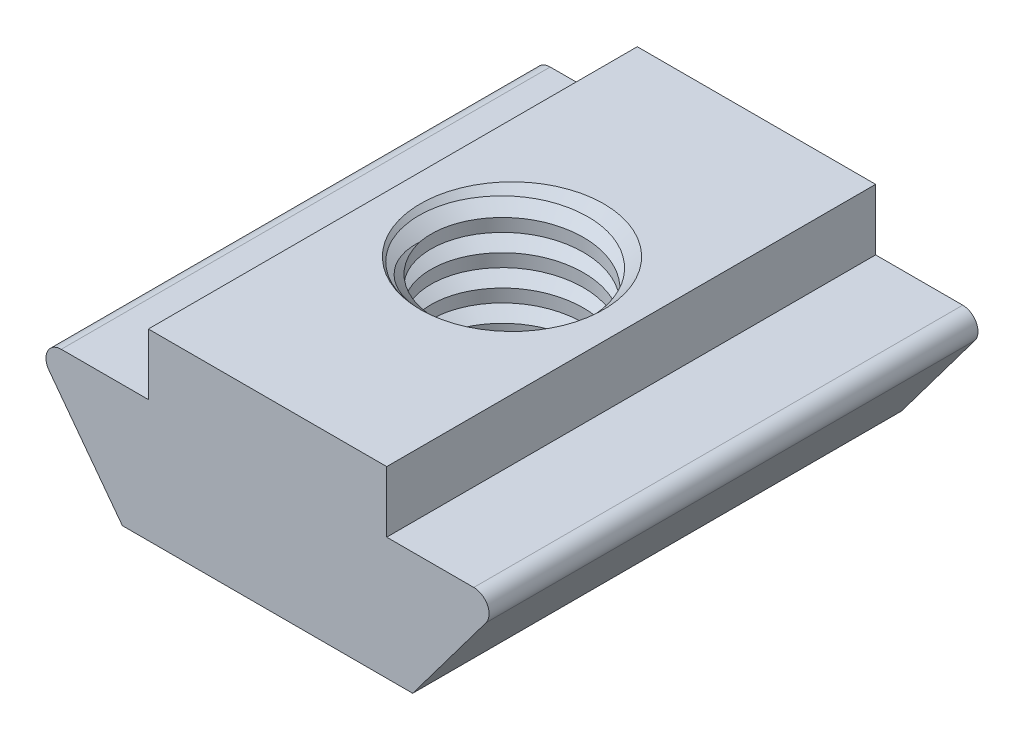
from build123d import *

# Parameters (mm, degrees)
EXTRUDE_1_DEPTH     = 8
SKETCH_7_R          = 2.5
CUT_EXTRUDE_2_DEPTH = 16
CHAMFER_2_SIZE      = 0.5
FILLET_2_R          = 0.5


with BuildPart() as part:
    # Sketch 1 → Extrude 1 (new, symmetric)
    with BuildSketch(Plane.XY):
        Polygon((-3.9, 4), (-3.9, 6), (3.9, 6), (3.9, 4), (7.75, 4), (4.75, 0), (-4.75, 0), (-7.75, 4), align=None)
    extrude(amount=EXTRUDE_1_DEPTH, both=True)

    # Sketch 7 → Cut-Extrude 2 (cut)
    with BuildSketch(Plane(origin=(0, 6, 0), x_dir=(1, 0, 0), z_dir=(0, 1, 0))):
        with Locations(Location((0, 0, 0), (0, 0, 180))):
            Circle(SKETCH_7_R)
    extrude(amount=-CUT_EXTRUDE_2_DEPTH, mode=Mode.SUBTRACT)

    # Chamfer 2
    chamfer_2_edges = [part.edges().sort_by_distance(p)[0] for p in [
        (2.5, 0, 0),
        (2.5, 6, 0),
    ]]
    chamfer(chamfer_2_edges, length=CHAMFER_2_SIZE)

    # Sweep 3: sweep along a curve in space
    with BuildLine() as sweep_3_path:
        add(Edge.make_bspline(
            [(-2.121320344, 6, -2.121320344), (-1.84541595, 5.979299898, -2.397224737), (-1.177131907, 5.937438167, -2.84460242), (-0.000216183, 5.875016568, -3.07788601), (1.177996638, 5.812495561, -2.843853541), (2.176531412, 5.75000119, -2.176531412), (2.843799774, 5.687499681, -1.177942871), (3.078101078, 5.625000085, 1.114e-06), (2.843795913, 5.562499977, 1.177938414), (2.176546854, 5.500000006, 2.176547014), (1.177938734, 5.437499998, 2.843795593), (-6e-09, 5.375, 3.078102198), (-1.177938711, 5.3125, 2.843795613), (-2.176546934, 5.25, 2.176546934), (-2.843795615, 5.1875, 1.177938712), (-3.078102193, 5.125, 0), (-2.843795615, 5.0625, -1.177938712), (-2.176546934, 5, -2.176546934), (-1.177938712, 4.9375, -2.843795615), (0, 4.875, -3.078102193), (1.177938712, 4.8125, -2.843795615), (2.176546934, 4.75, -2.176546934), (2.843795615, 4.6875, -1.177938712), (3.078102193, 4.625, 0), (2.843795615, 4.5625, 1.177938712), (2.176546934, 4.5, 2.176546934), (1.177938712, 4.4375, 2.843795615), (0, 4.375, 3.078102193), (-1.177938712, 4.3125, 2.843795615), (-2.176546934, 4.25, 2.176546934), (-2.843795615, 4.1875, 1.177938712), (-3.078102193, 4.125, 0), (-2.843795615, 4.0625, -1.177938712), (-2.176546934, 4, -2.176546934), (-1.177938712, 3.9375, -2.843795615), (0, 3.875, -3.078102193), (1.177938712, 3.8125, -2.843795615), (2.176546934, 3.75, -2.176546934), (2.843795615, 3.6875, -1.177938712), (3.078102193, 3.625, 0), (2.843795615, 3.5625, 1.177938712), (2.176546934, 3.5, 2.176546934), (1.177938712, 3.4375, 2.843795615), (0, 3.375, 3.078102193), (-1.177938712, 3.3125, 2.843795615), (-2.176546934, 3.25, 2.176546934), (-2.843795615, 3.1875, 1.177938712), (-3.078102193, 3.125, 0), (-2.843795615, 3.0625, -1.177938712), (-2.176546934, 3, -2.176546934), (-1.177938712, 2.9375, -2.843795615), (0, 2.875, -3.078102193), (1.177938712, 2.8125, -2.843795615), (2.176546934, 2.75, -2.176546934), (2.843795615, 2.6875, -1.177938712), (3.078102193, 2.625, 0), (2.843795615, 2.5625, 1.177938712), (2.176546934, 2.5, 2.176546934), (1.177938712, 2.4375, 2.843795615), (0, 2.375, 3.078102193), (-1.177938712, 2.3125, 2.843795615), (-2.176546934, 2.25, 2.176546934), (-2.843795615, 2.1875, 1.177938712), (-3.078102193, 2.125, 0), (-2.843795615, 2.0625, -1.177938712), (-2.176546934, 2, -2.176546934), (-1.177938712, 1.9375, -2.843795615), (0, 1.875, -3.078102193), (1.177938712, 1.8125, -2.843795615), (2.176546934, 1.75, -2.176546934), (2.843795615, 1.6875, -1.177938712), (3.078102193, 1.625, 0), (2.843795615, 1.5625, 1.177938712), (2.176546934, 1.5, 2.176546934), (1.177938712, 1.4375, 2.843795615), (0, 1.375, 3.078102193), (-1.177938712, 1.3125, 2.843795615), (-2.176546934, 1.25, 2.176546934), (-2.843795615, 1.1875, 1.177938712), (-3.078102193, 1.125, 0), (-2.843795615, 1.0625, -1.177938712), (-2.176546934, 1, -2.176546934), (-1.177938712, 0.9375, -2.843795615), (0, 0.875, -3.078102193), (1.177938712, 0.8125, -2.843795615), (2.176546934, 0.75, -2.176546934), (2.843795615, 0.6875, -1.177938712), (3.078102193, 0.625, 0), (2.843795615, 0.5625, 1.177938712), (2.176546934, 0.5, 2.176546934), (1.177938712, 0.4375, 2.843795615), (0, 0.375, 3.078102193), (-1.177938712, 0.3125, 2.843795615), (-2.176546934, 0.25, 2.176546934), (-2.843795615, 0.1875, 1.177938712), (-3.078102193, 0.125, 0), (-2.843795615, 0.0625, -1.177938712), (-2.176546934, 0, -2.176546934), (-1.177938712, -0.0625, -2.843795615), (0, -0.125, -3.078102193), (1.177938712, -0.1875, -2.843795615), (2.176546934, -0.25, -2.176546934), (2.843795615, -0.3125, -1.177938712), (3.078102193, -0.375, 0), (2.843795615, -0.4375, 1.177938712), (2.176546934, -0.5, 2.176546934), (1.177938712, -0.5625, 2.843795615), (0, -0.625, 3.078102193), (-1.177938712, -0.6875, 2.843795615), (-2.176546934, -0.75, 2.176546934), (-2.843795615, -0.8125, 1.177938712), (-3.078102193, -0.875, 0), (-2.843795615, -0.9375, -1.177938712), (-2.176546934, -1, -2.176546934), (-1.177938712, -1.0625, -2.843795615), (0, -1.125, -3.078102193), (1.177938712, -1.1875, -2.843795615), (2.176546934, -1.25, -2.176546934), (2.843795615, -1.3125, -1.177938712), (3.078102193, -1.375, 0), (2.843795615, -1.4375, 1.177938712), (2.176546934, -1.5, 2.176546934), (1.177938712, -1.5625, 2.843795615), (0, -1.625, 3.078102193), (-1.177938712, -1.6875, 2.843795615), (-2.176546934, -1.75, 2.176546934), (-2.843795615, -1.8125, 1.177938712), (-3.078102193, -1.875, 0), (-2.843795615, -1.9375, -1.177938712), (-2.176546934, -2, -2.176546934), (-1.177938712, -2.0625, -2.843795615), (0, -2.125, -3.078102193), (1.177938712, -2.1875, -2.843795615), (2.176546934, -2.25, -2.176546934), (2.843795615, -2.3125, -1.177938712), (3.078102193, -2.375, 0), (2.843795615, -2.4375, 1.177938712), (2.176546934, -2.5, 2.176546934), (1.177938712, -2.5625, 2.843795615), (0, -2.625, 3.078102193), (-1.177938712, -2.6875, 2.843795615), (-2.176546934, -2.75, 2.176546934), (-2.843795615, -2.8125, 1.177938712), (-3.078102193, -2.875, 0), (-2.843795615, -2.9375, -1.177938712), (-2.176546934, -3, -2.176546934), (-1.177938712, -3.0625, -2.843795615), (0, -3.125, -3.078102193), (1.177938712, -3.1875, -2.843795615), (2.176546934, -3.25, -2.176546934), (2.843795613, -3.3125, -1.177938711), (3.078102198, -3.375, -6e-09), (2.843795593, -3.437499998, 1.177938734), (2.176547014, -3.500000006, 2.176546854), (1.177938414, -3.562499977, 2.843795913), (1.114e-06, -3.625000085, 3.078101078), (-1.177942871, -3.687499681, 2.843799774), (-2.176531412, -3.75000119, 2.176531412), (-2.843853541, -3.812495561, 1.177996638), (-3.07788601, -3.875016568, -0.000216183), (-2.84460242, -3.937438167, -1.177131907), (-2.397224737, -3.979299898, -1.84541595), (-2.121320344, -4, -2.121320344)],
            knots=[0, 0, 0, 0, 0.00625, 0.0125, 0.01875, 0.025, 0.03125, 0.0375, 0.04375, 0.05, 0.05625, 0.0625, 0.06875, 0.075, 0.08125, 0.0875, 0.09375, 0.1, 0.10625, 0.1125, 0.11875, 0.125, 0.13125, 0.1375, 0.14375, 0.15, 0.15625, 0.1625, 0.16875, 0.175, 0.18125, 0.1875, 0.19375, 0.2, 0.20625, 0.2125, 0.21875, 0.225, 0.23125, 0.2375, 0.24375, 0.25, 0.25625, 0.2625, 0.26875, 0.275, 0.28125, 0.2875, 0.29375, 0.3, 0.30625, 0.3125, 0.31875, 0.325, 0.33125, 0.3375, 0.34375, 0.35, 0.35625, 0.3625, 0.36875, 0.375, 0.38125, 0.3875, 0.39375, 0.4, 0.40625, 0.4125, 0.41875, 0.425, 0.43125, 0.4375, 0.44375, 0.45, 0.45625, 0.4625, 0.46875, 0.475, 0.48125, 0.4875, 0.49375, 0.5, 0.50625, 0.5125, 0.51875, 0.525, 0.53125, 0.5375, 0.54375, 0.55, 0.55625, 0.5625, 0.56875, 0.575, 0.58125, 0.5875, 0.59375, 0.6, 0.60625, 0.6125, 0.61875, 0.625, 0.63125, 0.6375, 0.64375, 0.65, 0.65625, 0.6625, 0.66875, 0.675, 0.68125, 0.6875, 0.69375, 0.7, 0.70625, 0.7125, 0.71875, 0.725, 0.73125, 0.7375, 0.74375, 0.75, 0.75625, 0.7625, 0.76875, 0.775, 0.78125, 0.7875, 0.79375, 0.8, 0.80625, 0.8125, 0.81875, 0.825, 0.83125, 0.8375, 0.84375, 0.85, 0.85625, 0.8625, 0.86875, 0.875, 0.88125, 0.8875, 0.89375, 0.9, 0.90625, 0.9125, 0.91875, 0.925, 0.93125, 0.9375, 0.94375, 0.95, 0.95625, 0.9625, 0.96875, 0.975, 0.98125, 0.9875, 0.99375, 1, 1, 1, 1], degree=3))
    # Sketch 11 → Sweep 3 (sweep, cut)
    with BuildSketch(Plane(origin=(0, 0, 0), x_dir=(0, 0, -1), z_dir=(1, 0, 0))):
        Polygon((-3, 6), (-1.568523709, 5.173536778), (-1.568523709, 6.826463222), align=None)
    sweep(path=sweep_3_path.line, is_frenet=True, mode=Mode.SUBTRACT)

    # Fillet 2
    fillet_2_edges = [part.edges().sort_by_distance(p)[0] for p in [
        (7.75, 4, 0),
        (-7.75, 4, 0),
    ]]
    fillet(fillet_2_edges, radius=FILLET_2_R)


solid = part.part
